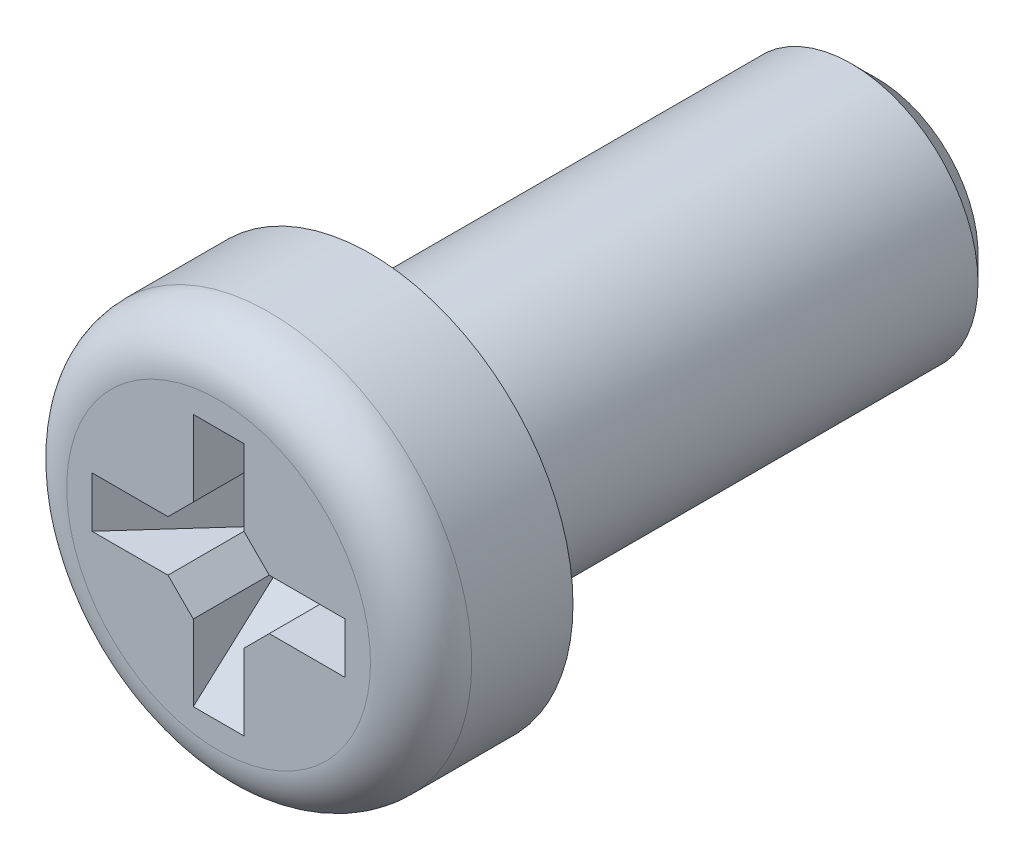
ISO-10303-21;
HEADER;
FILE_DESCRIPTION(('STEP AP214'),'2;1');
FILE_NAME('part.step','',(''),(''),'','','');
FILE_SCHEMA(('AUTOMOTIVE_DESIGN { 1 0 10303 214 1 1 1 1 }'));
ENDSEC;
DATA;
#1=APPLICATION_CONTEXT('core data for automotive mechanical design processes');
#2=APPLICATION_PROTOCOL_DEFINITION('international standard','automotive_design',2000,#1);
#3=PRODUCT_CONTEXT('',#1,'mechanical');
#4=PRODUCT('Part','Part','',(#3));
#5=PRODUCT_RELATED_PRODUCT_CATEGORY('part','',(#4));
#6=PRODUCT_DEFINITION_FORMATION('','',#4);
#7=PRODUCT_DEFINITION_CONTEXT('part definition',#1,'design');
#8=PRODUCT_DEFINITION('design','',#6,#7);
#9=PRODUCT_DEFINITION_SHAPE('','',#8);
#10=(LENGTH_UNIT() NAMED_UNIT(*) SI_UNIT(.MILLI.,.METRE.));
#11=(NAMED_UNIT(*) PLANE_ANGLE_UNIT() SI_UNIT($,.RADIAN.));
#12=(NAMED_UNIT(*) SI_UNIT($,.STERADIAN.) SOLID_ANGLE_UNIT());
#13=UNCERTAINTY_MEASURE_WITH_UNIT(LENGTH_MEASURE(1.E-05),#10,'distance_accuracy_value','');
#14=(GEOMETRIC_REPRESENTATION_CONTEXT(3) GLOBAL_UNCERTAINTY_ASSIGNED_CONTEXT((#13)) GLOBAL_UNIT_ASSIGNED_CONTEXT((#10,
#11,#12)) REPRESENTATION_CONTEXT('',''));
#15=CARTESIAN_POINT('',(0.,0.,0.));
#16=DIRECTION('',(0.,0.,1.));
#17=DIRECTION('',(1.,0.,0.));
#18=AXIS2_PLACEMENT_3D('',#15,#16,#17);
#19=CARTESIAN_POINT('',(1.25,0.25,1.5));
#20=DIRECTION('',(-0.743144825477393,0.,0.669130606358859));
#21=DIRECTION('',(0.669130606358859,0.,0.743144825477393));
#22=AXIS2_PLACEMENT_3D('',#19,#20,#21);
#23=PLANE('',#22);
#24=DIRECTION('',(-0.669130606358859,0.,-0.743144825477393));
#25=VECTOR('',#24,1.);
#26=CARTESIAN_POINT('',(1.25,0.25,1.5));
#27=LINE('',#26,#25);
#28=CARTESIAN_POINT('',(0.500000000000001,0.249999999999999,0.667040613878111));
#29=VERTEX_POINT('',#28);
#30=CARTESIAN_POINT('',(1.25,0.25,1.5));
#31=VERTEX_POINT('',#30);
#32=EDGE_CURVE('E221',#29,#31,#27,.F.);
#33=ORIENTED_EDGE('',*,*,#32,.F.);
#34=DIRECTION('',(-0.556117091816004,0.556117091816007,-0.617630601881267));
#35=VECTOR('',#34,1.);
#36=CARTESIAN_POINT('',(1.01805033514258,-0.268050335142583,1.24239379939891));
#37=LINE('',#36,#35);
#38=CARTESIAN_POINT('',(0.375,0.375,0.528214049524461));
#39=VERTEX_POINT('',#38);
#40=EDGE_CURVE('E268',#29,#39,#37,.T.);
#41=ORIENTED_EDGE('',*,*,#40,.T.);
#42=DIRECTION('',(-0.556117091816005,-0.556117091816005,-0.617630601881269));
#43=VECTOR('',#42,1.);
#44=CARTESIAN_POINT('',(0.786100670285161,0.786100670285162,0.984787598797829));
#45=LINE('',#44,#43);
#46=CARTESIAN_POINT('',(0.169515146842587,0.169515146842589,0.3));
#47=VERTEX_POINT('',#46);
#48=EDGE_CURVE('E240',#39,#47,#45,.T.);
#49=ORIENTED_EDGE('',*,*,#48,.T.);
#50=DIRECTION('',(0.,-1.,0.));
#51=VECTOR('',#50,1.);
#52=CARTESIAN_POINT('',(0.169515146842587,0.249999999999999,0.3));
#53=LINE('',#52,#51);
#54=CARTESIAN_POINT('',(0.169515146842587,-0.169515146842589,0.3));
#55=VERTEX_POINT('',#54);
#56=EDGE_CURVE('E224',#55,#47,#53,.F.);
#57=ORIENTED_EDGE('',*,*,#56,.F.);
#58=DIRECTION('',(-0.556117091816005,0.556117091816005,-0.617630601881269));
#59=VECTOR('',#58,1.);
#60=CARTESIAN_POINT('',(0.786100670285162,-0.786100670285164,0.98478759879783));
#61=LINE('',#60,#59);
#62=CARTESIAN_POINT('',(0.375,-0.375000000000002,0.528214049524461));
#63=VERTEX_POINT('',#62);
#64=EDGE_CURVE('E55',#63,#55,#61,.T.);
#65=ORIENTED_EDGE('',*,*,#64,.F.);
#66=DIRECTION('',(0.556117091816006,0.556117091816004,0.617630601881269));
#67=VECTOR('',#66,1.);
#68=CARTESIAN_POINT('',(1.17268344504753,0.422683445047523,1.41413126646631));
#69=LINE('',#68,#67);
#70=CARTESIAN_POINT('',(0.500000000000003,-0.249999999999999,0.667040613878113));
#71=VERTEX_POINT('',#70);
#72=EDGE_CURVE('E279',#63,#71,#69,.T.);
#73=ORIENTED_EDGE('',*,*,#72,.T.);
#74=DIRECTION('',(-0.669130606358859,0.,-0.743144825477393));
#75=VECTOR('',#74,1.);
#76=CARTESIAN_POINT('',(0.20555109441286,-0.249999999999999,0.340021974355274));
#77=LINE('',#76,#75);
#78=CARTESIAN_POINT('',(1.25,-0.25,1.5));
#79=VERTEX_POINT('',#78);
#80=EDGE_CURVE('E226',#71,#79,#77,.F.);
#81=ORIENTED_EDGE('',*,*,#80,.T.);
#82=DIRECTION('',(0.,1.,0.));
#83=VECTOR('',#82,1.);
#84=CARTESIAN_POINT('',(1.25,0.25,1.5));
#85=LINE('',#84,#83);
#86=EDGE_CURVE('E188',#79,#31,#85,.T.);
#87=ORIENTED_EDGE('',*,*,#86,.T.);
#88=EDGE_LOOP('',(#33,#41,#49,#57,#65,#73,#81,#87));
#89=FACE_BOUND('',#88,.T.);
#90=ADVANCED_FACE('F32',(#89),#23,.T.);
#91=CARTESIAN_POINT('',(-0.250000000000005,1.25,1.5));
#92=DIRECTION('',(0.,-0.743144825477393,0.669130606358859));
#93=DIRECTION('',(0.,-0.669130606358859,-0.743144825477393));
#94=AXIS2_PLACEMENT_3D('',#91,#92,#93);
#95=PLANE('',#94);
#96=ORIENTED_EDGE('',*,*,#48,.F.);
#97=DIRECTION('',(-0.556117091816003,0.556117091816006,0.61763060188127));
#98=VECTOR('',#97,1.);
#99=CARTESIAN_POINT('',(-0.422683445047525,1.17268344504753,1.41413126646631));
#100=LINE('',#99,#98);
#101=CARTESIAN_POINT('',(0.250000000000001,0.5,0.667040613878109));
#102=VERTEX_POINT('',#101);
#103=EDGE_CURVE('E271',#39,#102,#100,.T.);
#104=ORIENTED_EDGE('',*,*,#103,.T.);
#105=DIRECTION('',(0.,-0.669130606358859,-0.743144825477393));
#106=VECTOR('',#105,1.);
#107=CARTESIAN_POINT('',(0.250000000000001,0.653286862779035,0.83728292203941));
#108=LINE('',#107,#106);
#109=CARTESIAN_POINT('',(0.250000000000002,1.25,1.5));
#110=VERTEX_POINT('',#109);
#111=EDGE_CURVE('E219',#102,#110,#108,.F.);
#112=ORIENTED_EDGE('',*,*,#111,.T.);
#113=DIRECTION('',(-1.,0.,0.));
#114=VECTOR('',#113,1.);
#115=CARTESIAN_POINT('',(-0.250000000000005,1.25,1.5));
#116=LINE('',#115,#114);
#117=CARTESIAN_POINT('',(-0.250000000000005,1.25,1.5));
#118=VERTEX_POINT('',#117);
#119=EDGE_CURVE('E197',#110,#118,#116,.T.);
#120=ORIENTED_EDGE('',*,*,#119,.T.);
#121=DIRECTION('',(0.,-0.669130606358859,-0.743144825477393));
#122=VECTOR('',#121,1.);
#123=CARTESIAN_POINT('',(-0.250000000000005,1.25,1.5));
#124=LINE('',#123,#122);
#125=CARTESIAN_POINT('',(-0.250000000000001,0.5,0.667040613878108));
#126=VERTEX_POINT('',#125);
#127=EDGE_CURVE('E205',#126,#118,#124,.F.);
#128=ORIENTED_EDGE('',*,*,#127,.F.);
#129=DIRECTION('',(-0.556117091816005,-0.556117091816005,-0.617630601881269));
#130=VECTOR('',#129,1.);
#131=CARTESIAN_POINT('',(0.268050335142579,1.01805033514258,1.24239379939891));
#132=LINE('',#131,#130);
#133=CARTESIAN_POINT('',(-0.375000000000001,0.375,0.52821404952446));
#134=VERTEX_POINT('',#133);
#135=EDGE_CURVE('E273',#126,#134,#132,.T.);
#136=ORIENTED_EDGE('',*,*,#135,.T.);
#137=DIRECTION('',(0.556117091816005,-0.556117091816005,-0.617630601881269));
#138=VECTOR('',#137,1.);
#139=CARTESIAN_POINT('',(-0.94073378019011,0.94073378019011,1.15652506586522));
#140=LINE('',#139,#138);
#141=CARTESIAN_POINT('',(-0.16951514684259,0.169515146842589,0.3));
#142=VERTEX_POINT('',#141);
#143=EDGE_CURVE('E237',#134,#142,#140,.T.);
#144=ORIENTED_EDGE('',*,*,#143,.T.);
#145=DIRECTION('',(1.,0.,0.));
#146=VECTOR('',#145,1.);
#147=CARTESIAN_POINT('',(-0.25,0.169515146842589,0.3));
#148=LINE('',#147,#146);
#149=EDGE_CURVE('E158',#47,#142,#148,.F.);
#150=ORIENTED_EDGE('',*,*,#149,.F.);
#151=EDGE_LOOP('',(#96,#104,#112,#120,#128,#136,#144,#150));
#152=FACE_BOUND('',#151,.T.);
#153=ADVANCED_FACE('F34',(#152),#95,.T.);
#154=CARTESIAN_POINT('',(-0.250000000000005,-1.25,1.5));
#155=DIRECTION('',(0.,0.743144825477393,0.669130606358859));
#156=DIRECTION('',(0.,-0.669130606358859,0.743144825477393));
#157=AXIS2_PLACEMENT_3D('',#154,#155,#156);
#158=PLANE('',#157);
#159=DIRECTION('',(0.,0.669130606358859,-0.743144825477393));
#160=VECTOR('',#159,1.);
#161=CARTESIAN_POINT('',(0.250000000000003,-1.25,1.5));
#162=LINE('',#161,#160);
#163=CARTESIAN_POINT('',(0.250000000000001,-0.5,0.667040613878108));
#164=VERTEX_POINT('',#163);
#165=CARTESIAN_POINT('',(0.250000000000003,-1.25,1.5));
#166=VERTEX_POINT('',#165);
#167=EDGE_CURVE('E228',#164,#166,#162,.F.);
#168=ORIENTED_EDGE('',*,*,#167,.F.);
#169=DIRECTION('',(0.556117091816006,0.556117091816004,-0.617630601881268));
#170=VECTOR('',#169,1.);
#171=CARTESIAN_POINT('',(-0.42268344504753,-1.17268344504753,1.41413126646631));
#172=LINE('',#171,#170);
#173=EDGE_CURVE('E277',#164,#63,#172,.T.);
#174=ORIENTED_EDGE('',*,*,#173,.T.);
#175=ORIENTED_EDGE('',*,*,#64,.T.);
#176=DIRECTION('',(-1.,0.,0.));
#177=VECTOR('',#176,1.);
#178=CARTESIAN_POINT('',(-0.25,-0.169515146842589,0.3));
#179=LINE('',#178,#177);
#180=CARTESIAN_POINT('',(-0.16951514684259,-0.169515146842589,0.3));
#181=VERTEX_POINT('',#180);
#182=EDGE_CURVE('E216',#181,#55,#179,.F.);
#183=ORIENTED_EDGE('',*,*,#182,.F.);
#184=DIRECTION('',(0.556117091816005,0.556117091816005,-0.617630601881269));
#185=VECTOR('',#184,1.);
#186=CARTESIAN_POINT('',(-0.940733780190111,-0.94073378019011,1.15652506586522));
#187=LINE('',#186,#185);
#188=CARTESIAN_POINT('',(-0.375000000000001,-0.375,0.52821404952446));
#189=VERTEX_POINT('',#188);
#190=EDGE_CURVE('E47',#189,#181,#187,.T.);
#191=ORIENTED_EDGE('',*,*,#190,.F.);
#192=DIRECTION('',(0.556117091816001,-0.556117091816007,0.617630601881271));
#193=VECTOR('',#192,1.);
#194=CARTESIAN_POINT('',(0.268050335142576,-1.01805033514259,1.24239379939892));
#195=LINE('',#194,#193);
#196=CARTESIAN_POINT('',(-0.250000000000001,-0.500000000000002,0.66704061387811));
#197=VERTEX_POINT('',#196);
#198=EDGE_CURVE('E283',#189,#197,#195,.T.);
#199=ORIENTED_EDGE('',*,*,#198,.T.);
#200=DIRECTION('',(0.,0.669130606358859,-0.743144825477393));
#201=VECTOR('',#200,1.);
#202=CARTESIAN_POINT('',(-0.25,-0.205551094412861,0.340021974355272));
#203=LINE('',#202,#201);
#204=CARTESIAN_POINT('',(-0.250000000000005,-1.25,1.5));
#205=VERTEX_POINT('',#204);
#206=EDGE_CURVE('E218',#197,#205,#203,.F.);
#207=ORIENTED_EDGE('',*,*,#206,.T.);
#208=DIRECTION('',(1.,0.,0.));
#209=VECTOR('',#208,1.);
#210=CARTESIAN_POINT('',(-0.250000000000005,-1.25,1.5));
#211=LINE('',#210,#209);
#212=EDGE_CURVE('E179',#205,#166,#211,.T.);
#213=ORIENTED_EDGE('',*,*,#212,.T.);
#214=EDGE_LOOP('',(#168,#174,#175,#183,#191,#199,#207,#213));
#215=FACE_BOUND('',#214,.T.);
#216=ADVANCED_FACE('F305',(#215),#158,.T.);
#217=CARTESIAN_POINT('',(-1.25,0.25,1.5));
#218=DIRECTION('',(0.743144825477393,0.,0.669130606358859));
#219=DIRECTION('',(0.669130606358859,0.,-0.743144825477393));
#220=AXIS2_PLACEMENT_3D('',#217,#218,#219);
#221=PLANE('',#220);
#222=ORIENTED_EDGE('',*,*,#143,.F.);
#223=DIRECTION('',(-0.556117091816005,-0.556117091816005,0.617630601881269));
#224=VECTOR('',#223,1.);
#225=CARTESIAN_POINT('',(-1.01805033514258,-0.268050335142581,1.24239379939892));
#226=LINE('',#225,#224);
#227=CARTESIAN_POINT('',(-0.500000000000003,0.249999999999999,0.667040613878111));
#228=VERTEX_POINT('',#227);
#229=EDGE_CURVE('E153',#134,#228,#226,.T.);
#230=ORIENTED_EDGE('',*,*,#229,.T.);
#231=DIRECTION('',(0.669130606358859,0.,-0.743144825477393));
#232=VECTOR('',#231,1.);
#233=CARTESIAN_POINT('',(-0.653286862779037,0.249999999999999,0.83728292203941));
#234=LINE('',#233,#232);
#235=CARTESIAN_POINT('',(-1.25,0.25,1.5));
#236=VERTEX_POINT('',#235);
#237=EDGE_CURVE('E145',#228,#236,#234,.F.);
#238=ORIENTED_EDGE('',*,*,#237,.T.);
#239=DIRECTION('',(0.,-1.,0.));
#240=VECTOR('',#239,1.);
#241=CARTESIAN_POINT('',(-1.25,0.25,1.5));
#242=LINE('',#241,#240);
#243=CARTESIAN_POINT('',(-1.25,-0.25,1.5));
#244=VERTEX_POINT('',#243);
#245=EDGE_CURVE('E150',#236,#244,#242,.T.);
#246=ORIENTED_EDGE('',*,*,#245,.T.);
#247=DIRECTION('',(0.669130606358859,0.,-0.743144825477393));
#248=VECTOR('',#247,1.);
#249=CARTESIAN_POINT('',(-1.25,-0.25,1.5));
#250=LINE('',#249,#248);
#251=CARTESIAN_POINT('',(-0.500000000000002,-0.249999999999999,0.667040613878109));
#252=VERTEX_POINT('',#251);
#253=EDGE_CURVE('E157',#252,#244,#250,.F.);
#254=ORIENTED_EDGE('',*,*,#253,.F.);
#255=DIRECTION('',(0.556117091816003,-0.556117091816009,-0.617630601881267));
#256=VECTOR('',#255,1.);
#257=CARTESIAN_POINT('',(-1.17268344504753,0.422683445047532,1.4141312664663));
#258=LINE('',#257,#256);
#259=EDGE_CURVE('E281',#252,#189,#258,.T.);
#260=ORIENTED_EDGE('',*,*,#259,.T.);
#261=ORIENTED_EDGE('',*,*,#190,.T.);
#262=DIRECTION('',(0.,1.,0.));
#263=VECTOR('',#262,1.);
#264=CARTESIAN_POINT('',(-0.16951514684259,0.249999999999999,0.3));
#265=LINE('',#264,#263);
#266=EDGE_CURVE('E200',#142,#181,#265,.F.);
#267=ORIENTED_EDGE('',*,*,#266,.F.);
#268=EDGE_LOOP('',(#222,#230,#238,#246,#254,#260,#261,#267));
#269=FACE_BOUND('',#268,.T.);
#270=ADVANCED_FACE('F147',(#269),#221,.T.);
#271=CARTESIAN_POINT('',(0.,0.,0.));
#272=DIRECTION('',(0.,0.,1.));
#273=DIRECTION('',(1.,0.,0.));
#274=AXIS2_PLACEMENT_3D('',#271,#272,#273);
#275=PLANE('',#274);
#276=CARTESIAN_POINT('',(0.,0.,0.));
#277=DIRECTION('',(0.,0.,1.));
#278=DIRECTION('',(1.,0.,0.));
#279=AXIS2_PLACEMENT_3D('',#276,#277,#278);
#280=CIRCLE('',#279,2.);
#281=CARTESIAN_POINT('',(2.,0.,0.));
#282=VERTEX_POINT('',#281);
#283=EDGE_CURVE('E201',#282,#282,#280,.T.);
#284=ORIENTED_EDGE('',*,*,#283,.F.);
#285=EDGE_LOOP('',(#284));
#286=FACE_BOUND('',#285,.T.);
#287=CARTESIAN_POINT('',(0.,0.,0.));
#288=DIRECTION('',(0.,0.,1.));
#289=DIRECTION('',(1.,0.,0.));
#290=AXIS2_PLACEMENT_3D('',#287,#288,#289);
#291=CIRCLE('',#290,1.25);
#292=CARTESIAN_POINT('',(1.25,0.,0.));
#293=VERTEX_POINT('',#292);
#294=EDGE_CURVE('E204',#293,#293,#291,.F.);
#295=ORIENTED_EDGE('',*,*,#294,.F.);
#296=EDGE_LOOP('',(#295));
#297=FACE_BOUND('',#296,.T.);
#298=ADVANCED_FACE('F313',(#286,#297),#275,.F.);
#299=CARTESIAN_POINT('',(0.,0.,1.5));
#300=DIRECTION('',(0.,0.,-1.));
#301=DIRECTION('',(-1.,0.,0.));
#302=AXIS2_PLACEMENT_3D('',#299,#300,#301);
#303=CYLINDRICAL_SURFACE('',#302,2.);
#304=CARTESIAN_POINT('',(0.,0.,1.));
#305=DIRECTION('',(0.,0.,1.));
#306=DIRECTION('',(1.,0.,0.));
#307=AXIS2_PLACEMENT_3D('',#304,#305,#306);
#308=CIRCLE('',#307,2.);
#309=CARTESIAN_POINT('',(2.,0.,1.));
#310=VERTEX_POINT('',#309);
#311=EDGE_CURVE('E211',#310,#310,#308,.F.);
#312=ORIENTED_EDGE('',*,*,#311,.T.);
#313=EDGE_LOOP('',(#312));
#314=FACE_BOUND('',#313,.T.);
#315=ORIENTED_EDGE('',*,*,#283,.T.);
#316=EDGE_LOOP('',(#315));
#317=FACE_BOUND('',#316,.T.);
#318=ADVANCED_FACE('F314',(#314,#317),#303,.T.);
#319=CARTESIAN_POINT('',(0.,0.,1.5));
#320=DIRECTION('',(0.,0.,1.));
#321=DIRECTION('',(1.,0.,0.));
#322=AXIS2_PLACEMENT_3D('',#319,#320,#321);
#323=PLANE('',#322);
#324=DIRECTION('',(0.,1.,0.));
#325=VECTOR('',#324,1.);
#326=CARTESIAN_POINT('',(0.250000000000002,1.25,1.5));
#327=LINE('',#326,#325);
#328=CARTESIAN_POINT('',(0.250000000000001,0.500000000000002,1.5));
#329=VERTEX_POINT('',#328);
#330=EDGE_CURVE('E194',#329,#110,#327,.T.);
#331=ORIENTED_EDGE('',*,*,#330,.F.);
#332=DIRECTION('',(-0.707106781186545,0.70710678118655,0.));
#333=VECTOR('',#332,1.);
#334=CARTESIAN_POINT('',(0.375000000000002,0.374999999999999,1.5));
#335=LINE('',#334,#333);
#336=CARTESIAN_POINT('',(0.500000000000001,0.249999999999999,1.5));
#337=VERTEX_POINT('',#336);
#338=EDGE_CURVE('E251',#329,#337,#335,.F.);
#339=ORIENTED_EDGE('',*,*,#338,.T.);
#340=DIRECTION('',(-1.,0.,0.));
#341=VECTOR('',#340,1.);
#342=CARTESIAN_POINT('',(0.25,0.249999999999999,1.5));
#343=LINE('',#342,#341);
#344=EDGE_CURVE('E191',#31,#337,#343,.T.);
#345=ORIENTED_EDGE('',*,*,#344,.F.);
#346=ORIENTED_EDGE('',*,*,#86,.F.);
#347=DIRECTION('',(1.,0.,0.));
#348=VECTOR('',#347,1.);
#349=CARTESIAN_POINT('',(0.25,-0.249999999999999,1.5));
#350=LINE('',#349,#348);
#351=CARTESIAN_POINT('',(0.500000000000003,-0.249999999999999,1.5));
#352=VERTEX_POINT('',#351);
#353=EDGE_CURVE('E185',#352,#79,#350,.T.);
#354=ORIENTED_EDGE('',*,*,#353,.F.);
#355=DIRECTION('',(0.707106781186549,0.707106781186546,0.));
#356=VECTOR('',#355,1.);
#357=CARTESIAN_POINT('',(0.375,-0.375000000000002,1.5));
#358=LINE('',#357,#356);
#359=CARTESIAN_POINT('',(0.250000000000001,-0.5,1.5));
#360=VERTEX_POINT('',#359);
#361=EDGE_CURVE('E247',#352,#360,#358,.F.);
#362=ORIENTED_EDGE('',*,*,#361,.T.);
#363=DIRECTION('',(0.,1.,0.));
#364=VECTOR('',#363,1.);
#365=CARTESIAN_POINT('',(0.25,-0.249999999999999,1.5));
#366=LINE('',#365,#364);
#367=EDGE_CURVE('E182',#166,#360,#366,.T.);
#368=ORIENTED_EDGE('',*,*,#367,.F.);
#369=ORIENTED_EDGE('',*,*,#212,.F.);
#370=DIRECTION('',(0.,-1.,0.));
#371=VECTOR('',#370,1.);
#372=CARTESIAN_POINT('',(-0.25,-0.249999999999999,1.5));
#373=LINE('',#372,#371);
#374=CARTESIAN_POINT('',(-0.250000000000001,-0.500000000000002,1.5));
#375=VERTEX_POINT('',#374);
#376=EDGE_CURVE('E173',#375,#205,#373,.T.);
#377=ORIENTED_EDGE('',*,*,#376,.F.);
#378=DIRECTION('',(0.707106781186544,-0.707106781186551,0.));
#379=VECTOR('',#378,1.);
#380=CARTESIAN_POINT('',(-0.375000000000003,-0.374999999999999,1.5));
#381=LINE('',#380,#379);
#382=CARTESIAN_POINT('',(-0.500000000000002,-0.249999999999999,1.5));
#383=VERTEX_POINT('',#382);
#384=EDGE_CURVE('E245',#375,#383,#381,.F.);
#385=ORIENTED_EDGE('',*,*,#384,.T.);
#386=DIRECTION('',(1.,0.,0.));
#387=VECTOR('',#386,1.);
#388=CARTESIAN_POINT('',(-1.25,-0.25,1.5));
#389=LINE('',#388,#387);
#390=EDGE_CURVE('E171',#244,#383,#389,.T.);
#391=ORIENTED_EDGE('',*,*,#390,.F.);
#392=ORIENTED_EDGE('',*,*,#245,.F.);
#393=DIRECTION('',(-1.,0.,0.));
#394=VECTOR('',#393,1.);
#395=CARTESIAN_POINT('',(-1.25,0.25,1.5));
#396=LINE('',#395,#394);
#397=CARTESIAN_POINT('',(-0.500000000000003,0.249999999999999,1.5));
#398=VERTEX_POINT('',#397);
#399=EDGE_CURVE('E161',#398,#236,#396,.T.);
#400=ORIENTED_EDGE('',*,*,#399,.F.);
#401=DIRECTION('',(-0.707106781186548,-0.707106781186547,0.));
#402=VECTOR('',#401,1.);
#403=CARTESIAN_POINT('',(-0.375000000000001,0.375,1.5));
#404=LINE('',#403,#402);
#405=CARTESIAN_POINT('',(-0.250000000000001,0.5,1.5));
#406=VERTEX_POINT('',#405);
#407=EDGE_CURVE('E249',#398,#406,#404,.F.);
#408=ORIENTED_EDGE('',*,*,#407,.T.);
#409=DIRECTION('',(0.,-1.,0.));
#410=VECTOR('',#409,1.);
#411=CARTESIAN_POINT('',(-0.250000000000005,1.25,1.5));
#412=LINE('',#411,#410);
#413=EDGE_CURVE('E165',#118,#406,#412,.T.);
#414=ORIENTED_EDGE('',*,*,#413,.F.);
#415=ORIENTED_EDGE('',*,*,#119,.F.);
#416=EDGE_LOOP('',(#331,#339,#345,#346,#354,#362,#368,#369,#377,#385,#391,#392,#400,#408,#414,#415));
#417=FACE_BOUND('',#416,.T.);
#418=CARTESIAN_POINT('',(0.,0.,1.5));
#419=DIRECTION('',(0.,0.,1.));
#420=DIRECTION('',(1.,0.,0.));
#421=AXIS2_PLACEMENT_3D('',#418,#419,#420);
#422=CIRCLE('',#421,1.5);
#423=CARTESIAN_POINT('',(1.5,0.,1.5));
#424=VERTEX_POINT('',#423);
#425=EDGE_CURVE('E208',#424,#424,#422,.T.);
#426=ORIENTED_EDGE('',*,*,#425,.T.);
#427=EDGE_LOOP('',(#426));
#428=FACE_BOUND('',#427,.T.);
#429=ADVANCED_FACE('F168',(#417,#428),#323,.T.);
#430=CARTESIAN_POINT('',(0.,0.,-5.));
#431=DIRECTION('',(0.,0.,1.));
#432=DIRECTION('',(1.,0.,0.));
#433=AXIS2_PLACEMENT_3D('',#430,#431,#432);
#434=CYLINDRICAL_SURFACE('',#433,1.25);
#435=CARTESIAN_POINT('',(0.,0.,-4.75));
#436=DIRECTION('',(0.,0.,-1.));
#437=DIRECTION('',(-1.,0.,0.));
#438=AXIS2_PLACEMENT_3D('',#435,#436,#437);
#439=CIRCLE('',#438,1.25);
#440=CARTESIAN_POINT('',(-1.25,0.,-4.75));
#441=VERTEX_POINT('',#440);
#442=EDGE_CURVE('E11',#441,#441,#439,.F.);
#443=ORIENTED_EDGE('',*,*,#442,.T.);
#444=EDGE_LOOP('',(#443));
#445=FACE_BOUND('',#444,.T.);
#446=ORIENTED_EDGE('',*,*,#294,.T.);
#447=EDGE_LOOP('',(#446));
#448=FACE_BOUND('',#447,.T.);
#449=ADVANCED_FACE('F320',(#445,#448),#434,.T.);
#450=CARTESIAN_POINT('',(0.,0.,-5.));
#451=DIRECTION('',(0.,0.,-1.));
#452=DIRECTION('',(-1.,0.,0.));
#453=AXIS2_PLACEMENT_3D('',#450,#451,#452);
#454=PLANE('',#453);
#455=CARTESIAN_POINT('',(0.,0.,-5.));
#456=DIRECTION('',(0.,0.,-1.));
#457=DIRECTION('',(-1.,0.,0.));
#458=AXIS2_PLACEMENT_3D('',#455,#456,#457);
#459=CIRCLE('',#458,0.999999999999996);
#460=CARTESIAN_POINT('',(-0.999999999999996,0.,-5.));
#461=VERTEX_POINT('',#460);
#462=EDGE_CURVE('E40',#461,#461,#459,.T.);
#463=ORIENTED_EDGE('',*,*,#462,.T.);
#464=EDGE_LOOP('',(#463));
#465=FACE_BOUND('',#464,.T.);
#466=ADVANCED_FACE('F287',(#465),#454,.T.);
#467=CARTESIAN_POINT('',(0.,0.,1.));
#468=DIRECTION('',(0.,0.,1.));
#469=DIRECTION('',(1.,0.,0.));
#470=AXIS2_PLACEMENT_3D('',#467,#468,#469);
#471=TOROIDAL_SURFACE('',#470,1.5,0.5);
#472=ORIENTED_EDGE('',*,*,#311,.F.);
#473=EDGE_LOOP('',(#472));
#474=FACE_BOUND('',#473,.T.);
#475=ORIENTED_EDGE('',*,*,#425,.F.);
#476=EDGE_LOOP('',(#475));
#477=FACE_BOUND('',#476,.T.);
#478=ADVANCED_FACE('F329',(#474,#477),#471,.T.);
#479=CARTESIAN_POINT('',(-0.250000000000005,1.25,0.3));
#480=DIRECTION('',(-1.,0.,0.));
#481=DIRECTION('',(0.,-1.,0.));
#482=AXIS2_PLACEMENT_3D('',#479,#480,#481);
#483=PLANE('',#482);
#484=ORIENTED_EDGE('',*,*,#413,.T.);
#485=DIRECTION('',(0.,0.,-1.));
#486=VECTOR('',#485,1.);
#487=CARTESIAN_POINT('',(-0.250000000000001,0.5,0.3));
#488=LINE('',#487,#486);
#489=EDGE_CURVE('E256',#406,#126,#488,.T.);
#490=ORIENTED_EDGE('',*,*,#489,.T.);
#491=ORIENTED_EDGE('',*,*,#127,.T.);
#492=EDGE_LOOP('',(#484,#490,#491));
#493=FACE_BOUND('',#492,.T.);
#494=ADVANCED_FACE('F332',(#493),#483,.F.);
#495=CARTESIAN_POINT('',(0.250000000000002,1.25,0.3));
#496=DIRECTION('',(1.,0.,0.));
#497=DIRECTION('',(0.,1.,0.));
#498=AXIS2_PLACEMENT_3D('',#495,#496,#497);
#499=PLANE('',#498);
#500=ORIENTED_EDGE('',*,*,#111,.F.);
#501=DIRECTION('',(0.,0.,1.));
#502=VECTOR('',#501,1.);
#503=CARTESIAN_POINT('',(0.250000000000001,0.5,0.3));
#504=LINE('',#503,#502);
#505=EDGE_CURVE('E242',#102,#329,#504,.T.);
#506=ORIENTED_EDGE('',*,*,#505,.T.);
#507=ORIENTED_EDGE('',*,*,#330,.T.);
#508=EDGE_LOOP('',(#500,#506,#507));
#509=FACE_BOUND('',#508,.T.);
#510=ADVANCED_FACE('F336',(#509),#499,.F.);
#511=CARTESIAN_POINT('',(0.25,0.249999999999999,0.3));
#512=DIRECTION('',(0.,1.,0.));
#513=DIRECTION('',(-1.,0.,0.));
#514=AXIS2_PLACEMENT_3D('',#511,#512,#513);
#515=PLANE('',#514);
#516=ORIENTED_EDGE('',*,*,#344,.T.);
#517=DIRECTION('',(0.,0.,-1.));
#518=VECTOR('',#517,1.);
#519=CARTESIAN_POINT('',(0.500000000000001,0.249999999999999,0.3));
#520=LINE('',#519,#518);
#521=EDGE_CURVE('E253',#337,#29,#520,.T.);
#522=ORIENTED_EDGE('',*,*,#521,.T.);
#523=ORIENTED_EDGE('',*,*,#32,.T.);
#524=EDGE_LOOP('',(#516,#522,#523));
#525=FACE_BOUND('',#524,.T.);
#526=ADVANCED_FACE('F356',(#525),#515,.F.);
#527=CARTESIAN_POINT('',(0.25,-0.249999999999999,0.3));
#528=DIRECTION('',(0.,-1.,0.));
#529=DIRECTION('',(1.,0.,0.));
#530=AXIS2_PLACEMENT_3D('',#527,#528,#529);
#531=PLANE('',#530);
#532=ORIENTED_EDGE('',*,*,#80,.F.);
#533=DIRECTION('',(0.,0.,1.));
#534=VECTOR('',#533,1.);
#535=CARTESIAN_POINT('',(0.500000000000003,-0.249999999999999,0.3));
#536=LINE('',#535,#534);
#537=EDGE_CURVE('E258',#71,#352,#536,.T.);
#538=ORIENTED_EDGE('',*,*,#537,.T.);
#539=ORIENTED_EDGE('',*,*,#353,.T.);
#540=EDGE_LOOP('',(#532,#538,#539));
#541=FACE_BOUND('',#540,.T.);
#542=ADVANCED_FACE('F352',(#541),#531,.F.);
#543=CARTESIAN_POINT('',(0.25,-0.249999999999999,0.3));
#544=DIRECTION('',(1.,0.,0.));
#545=DIRECTION('',(0.,1.,0.));
#546=AXIS2_PLACEMENT_3D('',#543,#544,#545);
#547=PLANE('',#546);
#548=ORIENTED_EDGE('',*,*,#367,.T.);
#549=DIRECTION('',(0.,0.,-1.));
#550=VECTOR('',#549,1.);
#551=CARTESIAN_POINT('',(0.250000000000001,-0.5,0.3));
#552=LINE('',#551,#550);
#553=EDGE_CURVE('E261',#360,#164,#552,.T.);
#554=ORIENTED_EDGE('',*,*,#553,.T.);
#555=ORIENTED_EDGE('',*,*,#167,.T.);
#556=EDGE_LOOP('',(#548,#554,#555));
#557=FACE_BOUND('',#556,.T.);
#558=ADVANCED_FACE('F348',(#557),#547,.F.);
#559=CARTESIAN_POINT('',(-0.25,-0.249999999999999,0.3));
#560=DIRECTION('',(-1.,0.,0.));
#561=DIRECTION('',(0.,-1.,0.));
#562=AXIS2_PLACEMENT_3D('',#559,#560,#561);
#563=PLANE('',#562);
#564=ORIENTED_EDGE('',*,*,#206,.F.);
#565=DIRECTION('',(0.,0.,1.));
#566=VECTOR('',#565,1.);
#567=CARTESIAN_POINT('',(-0.250000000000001,-0.500000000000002,0.3));
#568=LINE('',#567,#566);
#569=EDGE_CURVE('E263',#197,#375,#568,.T.);
#570=ORIENTED_EDGE('',*,*,#569,.T.);
#571=ORIENTED_EDGE('',*,*,#376,.T.);
#572=EDGE_LOOP('',(#564,#570,#571));
#573=FACE_BOUND('',#572,.T.);
#574=ADVANCED_FACE('F344',(#573),#563,.F.);
#575=CARTESIAN_POINT('',(-1.25,-0.25,0.3));
#576=DIRECTION('',(0.,-1.,0.));
#577=DIRECTION('',(1.,0.,0.));
#578=AXIS2_PLACEMENT_3D('',#575,#576,#577);
#579=PLANE('',#578);
#580=ORIENTED_EDGE('',*,*,#390,.T.);
#581=DIRECTION('',(0.,0.,-1.));
#582=VECTOR('',#581,1.);
#583=CARTESIAN_POINT('',(-0.500000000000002,-0.249999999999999,0.3));
#584=LINE('',#583,#582);
#585=EDGE_CURVE('E266',#383,#252,#584,.T.);
#586=ORIENTED_EDGE('',*,*,#585,.T.);
#587=ORIENTED_EDGE('',*,*,#253,.T.);
#588=EDGE_LOOP('',(#580,#586,#587));
#589=FACE_BOUND('',#588,.T.);
#590=ADVANCED_FACE('F341',(#589),#579,.F.);
#591=CARTESIAN_POINT('',(-1.25,0.25,0.3));
#592=DIRECTION('',(0.,1.,0.));
#593=DIRECTION('',(-1.,0.,0.));
#594=AXIS2_PLACEMENT_3D('',#591,#592,#593);
#595=PLANE('',#594);
#596=ORIENTED_EDGE('',*,*,#237,.F.);
#597=DIRECTION('',(0.,0.,1.));
#598=VECTOR('',#597,1.);
#599=CARTESIAN_POINT('',(-0.500000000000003,0.249999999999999,0.3));
#600=LINE('',#599,#598);
#601=EDGE_CURVE('E163',#228,#398,#600,.T.);
#602=ORIENTED_EDGE('',*,*,#601,.T.);
#603=ORIENTED_EDGE('',*,*,#399,.T.);
#604=EDGE_LOOP('',(#596,#602,#603));
#605=FACE_BOUND('',#604,.T.);
#606=ADVANCED_FACE('F162',(#605),#595,.F.);
#607=CARTESIAN_POINT('',(-0.25,0.249999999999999,0.3));
#608=DIRECTION('',(0.,0.,1.));
#609=DIRECTION('',(1.,0.,0.));
#610=AXIS2_PLACEMENT_3D('',#607,#608,#609);
#611=PLANE('',#610);
#612=ORIENTED_EDGE('',*,*,#149,.T.);
#613=ORIENTED_EDGE('',*,*,#266,.T.);
#614=ORIENTED_EDGE('',*,*,#182,.T.);
#615=ORIENTED_EDGE('',*,*,#56,.T.);
#616=EDGE_LOOP('',(#612,#613,#614,#615));
#617=FACE_BOUND('',#616,.T.);
#618=ADVANCED_FACE('F340',(#617),#611,.T.);
#619=CARTESIAN_POINT('',(0.250000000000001,0.5,0.3));
#620=DIRECTION('',(0.70710678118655,0.707106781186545,0.));
#621=DIRECTION('',(-0.707106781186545,0.70710678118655,0.));
#622=AXIS2_PLACEMENT_3D('',#619,#620,#621);
#623=PLANE('',#622);
#624=ORIENTED_EDGE('',*,*,#40,.F.);
#625=ORIENTED_EDGE('',*,*,#521,.F.);
#626=ORIENTED_EDGE('',*,*,#338,.F.);
#627=ORIENTED_EDGE('',*,*,#505,.F.);
#628=ORIENTED_EDGE('',*,*,#103,.F.);
#629=EDGE_LOOP('',(#624,#625,#626,#627,#628));
#630=FACE_BOUND('',#629,.T.);
#631=ADVANCED_FACE('F366',(#630),#623,.F.);
#632=CARTESIAN_POINT('',(-0.500000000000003,0.249999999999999,0.3));
#633=DIRECTION('',(-0.707106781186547,0.707106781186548,0.));
#634=DIRECTION('',(-0.707106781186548,-0.707106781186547,0.));
#635=AXIS2_PLACEMENT_3D('',#632,#633,#634);
#636=PLANE('',#635);
#637=ORIENTED_EDGE('',*,*,#135,.F.);
#638=ORIENTED_EDGE('',*,*,#489,.F.);
#639=ORIENTED_EDGE('',*,*,#407,.F.);
#640=ORIENTED_EDGE('',*,*,#601,.F.);
#641=ORIENTED_EDGE('',*,*,#229,.F.);
#642=EDGE_LOOP('',(#637,#638,#639,#640,#641));
#643=FACE_BOUND('',#642,.T.);
#644=ADVANCED_FACE('F370',(#643),#636,.F.);
#645=CARTESIAN_POINT('',(0.500000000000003,-0.249999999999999,0.3));
#646=DIRECTION('',(0.707106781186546,-0.707106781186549,0.));
#647=DIRECTION('',(0.707106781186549,0.707106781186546,0.));
#648=AXIS2_PLACEMENT_3D('',#645,#646,#647);
#649=PLANE('',#648);
#650=ORIENTED_EDGE('',*,*,#173,.F.);
#651=ORIENTED_EDGE('',*,*,#553,.F.);
#652=ORIENTED_EDGE('',*,*,#361,.F.);
#653=ORIENTED_EDGE('',*,*,#537,.F.);
#654=ORIENTED_EDGE('',*,*,#72,.F.);
#655=EDGE_LOOP('',(#650,#651,#652,#653,#654));
#656=FACE_BOUND('',#655,.T.);
#657=ADVANCED_FACE('F297',(#656),#649,.F.);
#658=CARTESIAN_POINT('',(-0.250000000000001,-0.500000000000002,0.3));
#659=DIRECTION('',(-0.707106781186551,-0.707106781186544,0.));
#660=DIRECTION('',(0.707106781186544,-0.707106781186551,0.));
#661=AXIS2_PLACEMENT_3D('',#658,#659,#660);
#662=PLANE('',#661);
#663=ORIENTED_EDGE('',*,*,#259,.F.);
#664=ORIENTED_EDGE('',*,*,#585,.F.);
#665=ORIENTED_EDGE('',*,*,#384,.F.);
#666=ORIENTED_EDGE('',*,*,#569,.F.);
#667=ORIENTED_EDGE('',*,*,#198,.F.);
#668=EDGE_LOOP('',(#663,#664,#665,#666,#667));
#669=FACE_BOUND('',#668,.T.);
#670=ADVANCED_FACE('F291',(#669),#662,.F.);
#671=CARTESIAN_POINT('',(0.,0.,-5.));
#672=DIRECTION('',(0.,0.,1.));
#673=DIRECTION('',(1.,0.,0.));
#674=AXIS2_PLACEMENT_3D('',#671,#672,#673);
#675=CONICAL_SURFACE('',#674,0.999999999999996,0.785398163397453);
#676=ORIENTED_EDGE('',*,*,#442,.F.);
#677=EDGE_LOOP('',(#676));
#678=FACE_BOUND('',#677,.T.);
#679=ORIENTED_EDGE('',*,*,#462,.F.);
#680=EDGE_LOOP('',(#679));
#681=FACE_BOUND('',#680,.T.);
#682=ADVANCED_FACE('F289',(#678,#681),#675,.T.);
#683=CLOSED_SHELL('',(#90,#153,#216,#270,#298,#318,#429,#449,#466,#478,#494,#510,#526,#542,#558,
#574,#590,#606,#618,#631,#644,#657,#670,#682));
#684=MANIFOLD_SOLID_BREP('B2',#683);
#685=ADVANCED_BREP_SHAPE_REPRESENTATION('',(#18,#684),#14);
#686=SHAPE_DEFINITION_REPRESENTATION(#9,#685);
ENDSEC;
END-ISO-10303-21;
